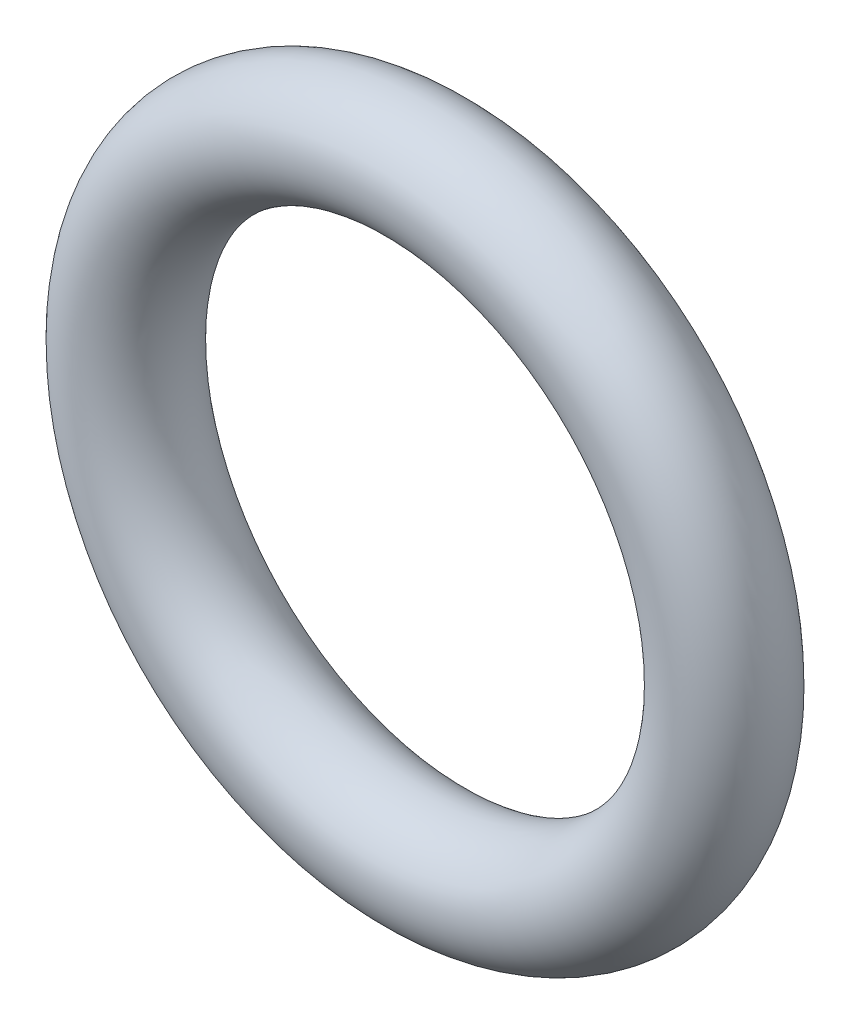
from build123d import *

# Parameters (mm, degrees)
SKETCH1_R = 0.889


with BuildPart() as part:
    # Sketch1 → Revolve1 (revolve)
    with BuildSketch(Plane(origin=(0, 0, 0), x_dir=(0, -1, 0), z_dir=(1, 0, 0)), mode=Mode.PRIVATE) as revolve1_sk:
        with Locations((4.7117, 0)):
            Circle(SKETCH1_R)
    revolve(revolve1_sk.sketch.rotate(Axis((0, 0, 0.889), (0, 0, -1)), 270), axis=Axis((0, 0, 0.889), (0, 0, -1)))


solid = part.part
